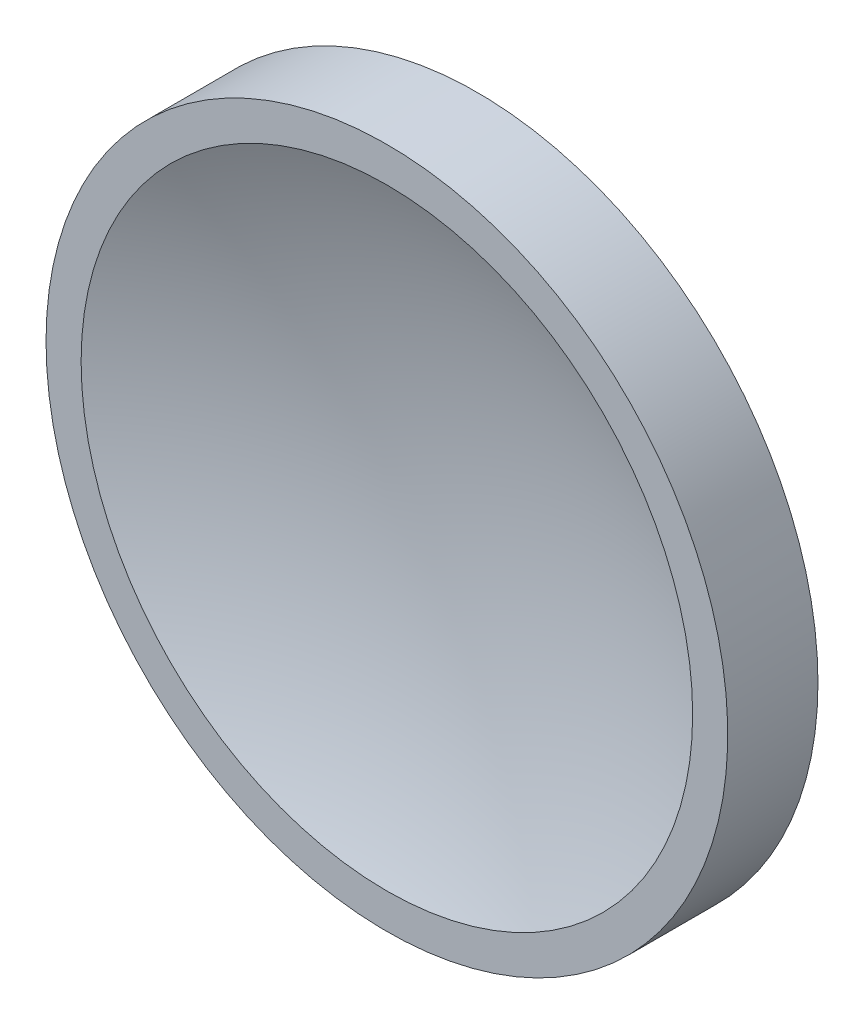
ISO-10303-21;
HEADER;
FILE_DESCRIPTION(('STEP AP214'),'2;1');
FILE_NAME('part.step','',(''),(''),'','','');
FILE_SCHEMA(('AUTOMOTIVE_DESIGN { 1 0 10303 214 1 1 1 1 }'));
ENDSEC;
DATA;
#1=APPLICATION_CONTEXT('core data for automotive mechanical design processes');
#2=APPLICATION_PROTOCOL_DEFINITION('international standard','automotive_design',2000,#1);
#3=PRODUCT_CONTEXT('',#1,'mechanical');
#4=PRODUCT('Part','Part','',(#3));
#5=PRODUCT_RELATED_PRODUCT_CATEGORY('part','',(#4));
#6=PRODUCT_DEFINITION_FORMATION('','',#4);
#7=PRODUCT_DEFINITION_CONTEXT('part definition',#1,'design');
#8=PRODUCT_DEFINITION('design','',#6,#7);
#9=PRODUCT_DEFINITION_SHAPE('','',#8);
#10=(LENGTH_UNIT() NAMED_UNIT(*) SI_UNIT(.MILLI.,.METRE.));
#11=(NAMED_UNIT(*) PLANE_ANGLE_UNIT() SI_UNIT($,.RADIAN.));
#12=(NAMED_UNIT(*) SI_UNIT($,.STERADIAN.) SOLID_ANGLE_UNIT());
#13=UNCERTAINTY_MEASURE_WITH_UNIT(LENGTH_MEASURE(1.E-05),#10,'distance_accuracy_value','');
#14=(GEOMETRIC_REPRESENTATION_CONTEXT(3) GLOBAL_UNCERTAINTY_ASSIGNED_CONTEXT((#13)) GLOBAL_UNIT_ASSIGNED_CONTEXT((#10,
#11,#12)) REPRESENTATION_CONTEXT('',''));
#15=CARTESIAN_POINT('',(0.,0.,0.));
#16=DIRECTION('',(0.,0.,1.));
#17=DIRECTION('',(1.,0.,0.));
#18=AXIS2_PLACEMENT_3D('',#15,#16,#17);
#19=CARTESIAN_POINT('',(0.,0.,5.288));
#20=DIRECTION('',(0.,0.,-1.));
#21=DIRECTION('',(-1.,0.,0.));
#22=AXIS2_PLACEMENT_3D('',#19,#20,#21);
#23=CYLINDRICAL_SURFACE('',#22,17.);
#24=CARTESIAN_POINT('',(0.,0.,4.49967860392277));
#25=DIRECTION('',(0.,0.,-1.));
#26=DIRECTION('',(-1.,0.,0.));
#27=AXIS2_PLACEMENT_3D('',#24,#25,#26);
#28=CIRCLE('',#27,17.);
#29=CARTESIAN_POINT('',(-17.,0.,4.49967860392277));
#30=VERTEX_POINT('',#29);
#31=EDGE_CURVE('E44',#30,#30,#28,.T.);
#32=ORIENTED_EDGE('',*,*,#31,.T.);
#33=EDGE_LOOP('',(#32));
#34=FACE_BOUND('',#33,.T.);
#35=CARTESIAN_POINT('',(0.,0.,0.));
#36=DIRECTION('',(0.,0.,1.));
#37=DIRECTION('',(1.,0.,0.));
#38=AXIS2_PLACEMENT_3D('',#35,#36,#37);
#39=CIRCLE('',#38,17.);
#40=CARTESIAN_POINT('',(17.,0.,0.));
#41=VERTEX_POINT('',#40);
#42=EDGE_CURVE('E10',#41,#41,#39,.T.);
#43=ORIENTED_EDGE('',*,*,#42,.T.);
#44=EDGE_LOOP('',(#43));
#45=FACE_BOUND('',#44,.T.);
#46=ADVANCED_FACE('F38',(#34,#45),#23,.T.);
#47=CARTESIAN_POINT('',(0.,0.,52.9887837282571));
#48=DIRECTION('',(0.,0.,1.));
#49=DIRECTION('',(1.,0.,0.));
#50=AXIS2_PLACEMENT_3D('',#47,#48,#49);
#51=SPHERICAL_SURFACE('',#50,55.649);
#52=ORIENTED_EDGE('',*,*,#42,.F.);
#53=EDGE_LOOP('',(#52));
#54=FACE_BOUND('',#53,.T.);
#55=ADVANCED_FACE('F63',(#54),#51,.T.);
#56=CARTESIAN_POINT('',(-17.,0.,4.49967860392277));
#57=DIRECTION('',(0.,0.,-1.));
#58=DIRECTION('',(-1.,0.,0.));
#59=AXIS2_PLACEMENT_3D('',#56,#57,#58);
#60=PLANE('',#59);
#61=ORIENTED_EDGE('',*,*,#31,.F.);
#62=EDGE_LOOP('',(#61));
#63=FACE_BOUND('',#62,.T.);
#64=CARTESIAN_POINT('',(0.,0.,4.49967860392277));
#65=DIRECTION('',(0.,0.,-1.));
#66=DIRECTION('',(-1.,0.,0.));
#67=AXIS2_PLACEMENT_3D('',#64,#65,#66);
#68=CIRCLE('',#67,15.25);
#69=CARTESIAN_POINT('',(-15.25,0.,4.49967860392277));
#70=VERTEX_POINT('',#69);
#71=EDGE_CURVE('E48',#70,#70,#68,.T.);
#72=ORIENTED_EDGE('',*,*,#71,.T.);
#73=EDGE_LOOP('',(#72));
#74=FACE_BOUND('',#73,.T.);
#75=ADVANCED_FACE('F55',(#63,#74),#60,.F.);
#76=CARTESIAN_POINT('',(0.,0.,40.6898358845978));
#77=DIRECTION('',(0.,0.,-1.));
#78=DIRECTION('',(1.,0.,0.));
#79=AXIS2_PLACEMENT_3D('',#76,#77,#78);
#80=SPHERICAL_SURFACE('',#79,39.272);
#81=ORIENTED_EDGE('',*,*,#71,.F.);
#82=EDGE_LOOP('',(#81));
#83=FACE_BOUND('',#82,.T.);
#84=ADVANCED_FACE('F57',(#83),#80,.F.);
#85=CLOSED_SHELL('',(#46,#55,#75,#84));
#86=MANIFOLD_SOLID_BREP('B2',#85);
#87=ADVANCED_BREP_SHAPE_REPRESENTATION('',(#18,#86),#14);
#88=SHAPE_DEFINITION_REPRESENTATION(#9,#87);
ENDSEC;
END-ISO-10303-21;
